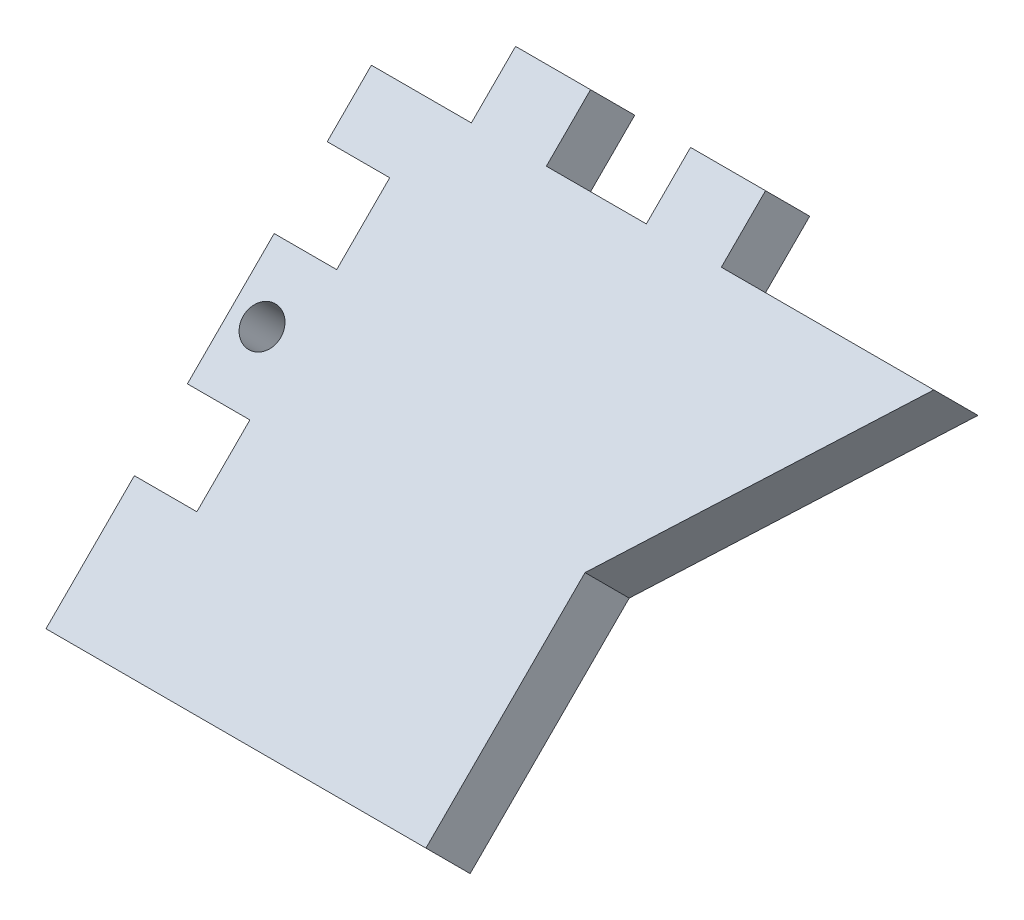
ISO-10303-21;
HEADER;
FILE_DESCRIPTION(('STEP AP214'),'2;1');
FILE_NAME('part.step','',(''),(''),'','','');
FILE_SCHEMA(('AUTOMOTIVE_DESIGN { 1 0 10303 214 1 1 1 1 }'));
ENDSEC;
DATA;
#1=APPLICATION_CONTEXT('core data for automotive mechanical design processes');
#2=APPLICATION_PROTOCOL_DEFINITION('international standard','automotive_design',2000,#1);
#3=PRODUCT_CONTEXT('',#1,'mechanical');
#4=PRODUCT('Part','Part','',(#3));
#5=PRODUCT_RELATED_PRODUCT_CATEGORY('part','',(#4));
#6=PRODUCT_DEFINITION_FORMATION('','',#4);
#7=PRODUCT_DEFINITION_CONTEXT('part definition',#1,'design');
#8=PRODUCT_DEFINITION('design','',#6,#7);
#9=PRODUCT_DEFINITION_SHAPE('','',#8);
#10=(LENGTH_UNIT() NAMED_UNIT(*) SI_UNIT(.MILLI.,.METRE.));
#11=(NAMED_UNIT(*) PLANE_ANGLE_UNIT() SI_UNIT($,.RADIAN.));
#12=(NAMED_UNIT(*) SI_UNIT($,.STERADIAN.) SOLID_ANGLE_UNIT());
#13=UNCERTAINTY_MEASURE_WITH_UNIT(LENGTH_MEASURE(1.E-05),#10,'distance_accuracy_value','');
#14=(GEOMETRIC_REPRESENTATION_CONTEXT(3) GLOBAL_UNCERTAINTY_ASSIGNED_CONTEXT((#13)) GLOBAL_UNIT_ASSIGNED_CONTEXT((#10,
#11,#12)) REPRESENTATION_CONTEXT('',''));
#15=CARTESIAN_POINT('',(0.,0.,0.));
#16=DIRECTION('',(0.,0.,1.));
#17=DIRECTION('',(1.,0.,0.));
#18=AXIS2_PLACEMENT_3D('',#15,#16,#17);
#19=CARTESIAN_POINT('',(0.,18.8585378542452,-9.87828173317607));
#20=DIRECTION('',(0.,0.707106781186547,-0.707106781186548));
#21=DIRECTION('',(0.,0.707106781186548,0.707106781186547));
#22=AXIS2_PLACEMENT_3D('',#19,#20,#21);
#23=PLANE('',#22);
#24=DIRECTION('',(1.,0.,0.));
#25=VECTOR('',#24,1.);
#26=CARTESIAN_POINT('',(0.,14.3684097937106,-14.3684097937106));
#27=LINE('',#26,#25);
#28=CARTESIAN_POINT('',(0.,14.3684097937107,-14.3684097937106));
#29=VERTEX_POINT('',#28);
#30=CARTESIAN_POINT('',(6.35,14.3684097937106,-14.3684097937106));
#31=VERTEX_POINT('',#30);
#32=EDGE_CURVE('E230',#29,#31,#27,.T.);
#33=ORIENTED_EDGE('',*,*,#32,.T.);
#34=DIRECTION('',(0.,-0.707106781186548,-0.707106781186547));
#35=VECTOR('',#34,1.);
#36=CARTESIAN_POINT('',(6.35,18.8585378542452,-9.87828173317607));
#37=LINE('',#36,#35);
#38=CARTESIAN_POINT('',(6.35,18.8585378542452,-9.87828173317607));
#39=VERTEX_POINT('',#38);
#40=EDGE_CURVE('E11',#39,#31,#37,.T.);
#41=ORIENTED_EDGE('',*,*,#40,.F.);
#42=DIRECTION('',(1.,0.,0.));
#43=VECTOR('',#42,1.);
#44=CARTESIAN_POINT('',(0.,18.8585378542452,-9.87828173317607));
#45=LINE('',#44,#43);
#46=CARTESIAN_POINT('',(0.,18.8585378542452,-9.87828173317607));
#47=VERTEX_POINT('',#46);
#48=EDGE_CURVE('E376',#47,#39,#45,.T.);
#49=ORIENTED_EDGE('',*,*,#48,.F.);
#50=DIRECTION('',(0.,-0.707106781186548,-0.707106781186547));
#51=VECTOR('',#50,1.);
#52=CARTESIAN_POINT('',(0.,18.8585378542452,-9.87828173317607));
#53=LINE('',#52,#51);
#54=EDGE_CURVE('E64',#47,#29,#53,.T.);
#55=ORIENTED_EDGE('',*,*,#54,.T.);
#56=EDGE_LOOP('',(#33,#41,#49,#55));
#57=FACE_BOUND('',#56,.T.);
#58=ADVANCED_FACE('F47',(#57),#23,.F.);
#59=CARTESIAN_POINT('',(6.35,4.49012806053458,4.49012806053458));
#60=DIRECTION('',(1.,0.,0.));
#61=DIRECTION('',(0.,0.,-1.));
#62=AXIS2_PLACEMENT_3D('',#59,#60,#61);
#63=PLANE('',#62);
#64=DIRECTION('',(0.,-0.707106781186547,0.707106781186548));
#65=VECTOR('',#64,1.);
#66=CARTESIAN_POINT('',(6.35,0.,0.));
#67=LINE('',#66,#65);
#68=CARTESIAN_POINT('',(6.35,8.98025612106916,-8.98025612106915));
#69=VERTEX_POINT('',#68);
#70=EDGE_CURVE('E233',#31,#69,#67,.T.);
#71=ORIENTED_EDGE('',*,*,#70,.T.);
#72=DIRECTION('',(0.,-0.707106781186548,-0.707106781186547));
#73=VECTOR('',#72,1.);
#74=CARTESIAN_POINT('',(6.35,13.4703841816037,-4.49012806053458));
#75=LINE('',#74,#73);
#76=CARTESIAN_POINT('',(6.35,13.4703841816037,-4.49012806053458));
#77=VERTEX_POINT('',#76);
#78=EDGE_CURVE('E56',#77,#69,#75,.T.);
#79=ORIENTED_EDGE('',*,*,#78,.F.);
#80=DIRECTION('',(0.,-0.707106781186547,0.707106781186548));
#81=VECTOR('',#80,1.);
#82=CARTESIAN_POINT('',(6.35,4.49012806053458,4.49012806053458));
#83=LINE('',#82,#81);
#84=EDGE_CURVE('E141',#39,#77,#83,.T.);
#85=ORIENTED_EDGE('',*,*,#84,.F.);
#86=ORIENTED_EDGE('',*,*,#40,.T.);
#87=EDGE_LOOP('',(#71,#79,#85,#86));
#88=FACE_BOUND('',#87,.T.);
#89=ADVANCED_FACE('F358',(#88),#63,.F.);
#90=CARTESIAN_POINT('',(0.,13.4703841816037,-4.49012806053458));
#91=DIRECTION('',(0.,0.707106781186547,-0.707106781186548));
#92=DIRECTION('',(0.,0.707106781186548,0.707106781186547));
#93=AXIS2_PLACEMENT_3D('',#90,#91,#92);
#94=PLANE('',#93);
#95=DIRECTION('',(1.,0.,0.));
#96=VECTOR('',#95,1.);
#97=CARTESIAN_POINT('',(0.,8.98025612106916,-8.98025612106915));
#98=LINE('',#97,#96);
#99=CARTESIAN_POINT('',(0.,8.98025612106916,-8.98025612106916));
#100=VERTEX_POINT('',#99);
#101=EDGE_CURVE('E238',#100,#69,#98,.T.);
#102=ORIENTED_EDGE('',*,*,#101,.F.);
#103=DIRECTION('',(0.,-0.707106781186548,-0.707106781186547));
#104=VECTOR('',#103,1.);
#105=CARTESIAN_POINT('',(0.,13.4703841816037,-4.49012806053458));
#106=LINE('',#105,#104);
#107=CARTESIAN_POINT('',(0.,13.4703841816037,-4.49012806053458));
#108=VERTEX_POINT('',#107);
#109=EDGE_CURVE('E349',#108,#100,#106,.T.);
#110=ORIENTED_EDGE('',*,*,#109,.F.);
#111=DIRECTION('',(1.,0.,0.));
#112=VECTOR('',#111,1.);
#113=CARTESIAN_POINT('',(0.,13.4703841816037,-4.49012806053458));
#114=LINE('',#113,#112);
#115=EDGE_CURVE('E357',#108,#77,#114,.T.);
#116=ORIENTED_EDGE('',*,*,#115,.T.);
#117=ORIENTED_EDGE('',*,*,#78,.T.);
#118=EDGE_LOOP('',(#102,#110,#116,#117));
#119=FACE_BOUND('',#118,.T.);
#120=ADVANCED_FACE('F355',(#119),#94,.T.);
#121=CARTESIAN_POINT('',(0.,4.49012806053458,4.49012806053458));
#122=DIRECTION('',(-1.,0.,0.));
#123=DIRECTION('',(0.,0.,1.));
#124=AXIS2_PLACEMENT_3D('',#121,#122,#123);
#125=PLANE('',#124);
#126=DIRECTION('',(0.,0.707106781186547,-0.707106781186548));
#127=VECTOR('',#126,1.);
#128=CARTESIAN_POINT('',(0.,0.,0.));
#129=LINE('',#128,#127);
#130=CARTESIAN_POINT('',(0.,0.,0.));
#131=VERTEX_POINT('',#130);
#132=EDGE_CURVE('E242',#131,#100,#129,.T.);
#133=ORIENTED_EDGE('',*,*,#132,.F.);
#134=DIRECTION('',(0.,-0.707106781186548,-0.707106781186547));
#135=VECTOR('',#134,1.);
#136=CARTESIAN_POINT('',(0.,4.49012806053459,4.49012806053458));
#137=LINE('',#136,#135);
#138=CARTESIAN_POINT('',(0.,4.49012806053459,4.49012806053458));
#139=VERTEX_POINT('',#138);
#140=EDGE_CURVE('E346',#139,#131,#137,.T.);
#141=ORIENTED_EDGE('',*,*,#140,.F.);
#142=DIRECTION('',(0.,0.707106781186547,-0.707106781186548));
#143=VECTOR('',#142,1.);
#144=CARTESIAN_POINT('',(0.,4.49012806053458,4.49012806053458));
#145=LINE('',#144,#143);
#146=EDGE_CURVE('E227',#139,#108,#145,.T.);
#147=ORIENTED_EDGE('',*,*,#146,.T.);
#148=ORIENTED_EDGE('',*,*,#109,.T.);
#149=EDGE_LOOP('',(#133,#141,#147,#148));
#150=FACE_BOUND('',#149,.T.);
#151=ADVANCED_FACE('F366',(#150),#125,.T.);
#152=CARTESIAN_POINT('',(0.,4.49012806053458,4.49012806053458));
#153=DIRECTION('',(0.,-0.707106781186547,0.707106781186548));
#154=DIRECTION('',(0.,-0.707106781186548,-0.707106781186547));
#155=AXIS2_PLACEMENT_3D('',#152,#153,#154);
#156=PLANE('',#155);
#157=DIRECTION('',(-1.,0.,0.));
#158=VECTOR('',#157,1.);
#159=CARTESIAN_POINT('',(0.,0.,0.));
#160=LINE('',#159,#158);
#161=CARTESIAN_POINT('',(38.608,0.,0.));
#162=VERTEX_POINT('',#161);
#163=EDGE_CURVE('E246',#162,#131,#160,.T.);
#164=ORIENTED_EDGE('',*,*,#163,.F.);
#165=DIRECTION('',(0.,-0.707106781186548,-0.707106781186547));
#166=VECTOR('',#165,1.);
#167=CARTESIAN_POINT('',(38.608,4.49012806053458,4.49012806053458));
#168=LINE('',#167,#166);
#169=CARTESIAN_POINT('',(38.608,4.49012806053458,4.49012806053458));
#170=VERTEX_POINT('',#169);
#171=EDGE_CURVE('E343',#170,#162,#168,.T.);
#172=ORIENTED_EDGE('',*,*,#171,.F.);
#173=DIRECTION('',(-1.,0.,0.));
#174=VECTOR('',#173,1.);
#175=CARTESIAN_POINT('',(0.,4.49012806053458,4.49012806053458));
#176=LINE('',#175,#174);
#177=EDGE_CURVE('E375',#170,#139,#176,.T.);
#178=ORIENTED_EDGE('',*,*,#177,.T.);
#179=ORIENTED_EDGE('',*,*,#140,.T.);
#180=EDGE_LOOP('',(#164,#172,#178,#179));
#181=FACE_BOUND('',#180,.T.);
#182=ADVANCED_FACE('F473',(#181),#156,.T.);
#183=CARTESIAN_POINT('',(38.608,4.49012806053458,4.49012806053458));
#184=DIRECTION('',(-1.,0.,0.));
#185=DIRECTION('',(0.,0.,1.));
#186=AXIS2_PLACEMENT_3D('',#183,#184,#185);
#187=PLANE('',#186);
#188=DIRECTION('',(0.,0.707106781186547,-0.707106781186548));
#189=VECTOR('',#188,1.);
#190=CARTESIAN_POINT('',(38.608,0.,0.));
#191=LINE('',#190,#189);
#192=CARTESIAN_POINT('',(38.608,16.1644610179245,-16.1644610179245));
#193=VERTEX_POINT('',#192);
#194=EDGE_CURVE('E252',#162,#193,#191,.T.);
#195=ORIENTED_EDGE('',*,*,#194,.T.);
#196=DIRECTION('',(0.,-0.707106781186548,-0.707106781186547));
#197=VECTOR('',#196,1.);
#198=CARTESIAN_POINT('',(38.608,20.6545890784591,-11.6743329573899));
#199=LINE('',#198,#197);
#200=CARTESIAN_POINT('',(38.608,20.6545890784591,-11.6743329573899));
#201=VERTEX_POINT('',#200);
#202=EDGE_CURVE('E340',#201,#193,#199,.T.);
#203=ORIENTED_EDGE('',*,*,#202,.F.);
#204=DIRECTION('',(0.,0.707106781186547,-0.707106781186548));
#205=VECTOR('',#204,1.);
#206=CARTESIAN_POINT('',(38.608,4.49012806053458,4.49012806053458));
#207=LINE('',#206,#205);
#208=EDGE_CURVE('E382',#170,#201,#207,.T.);
#209=ORIENTED_EDGE('',*,*,#208,.F.);
#210=ORIENTED_EDGE('',*,*,#171,.T.);
#211=EDGE_LOOP('',(#195,#203,#209,#210));
#212=FACE_BOUND('',#211,.T.);
#213=ADVANCED_FACE('F476',(#212),#187,.F.);
#214=CARTESIAN_POINT('',(13.0291407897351,-2.65779996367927,11.6380560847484));
#215=DIRECTION('',(0.790088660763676,-0.433451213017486,0.433451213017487));
#216=DIRECTION('',(0.480983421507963,0.,-0.876729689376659));
#217=AXIS2_PLACEMENT_3D('',#214,#215,#216);
#218=PLANE('',#217);
#219=DIRECTION('',(-0.612992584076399,-0.558677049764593,0.558677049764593));
#220=VECTOR('',#219,1.);
#221=CARTESIAN_POINT('',(13.0291407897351,-7.14792802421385,7.14792802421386));
#222=LINE('',#221,#220);
#223=CARTESIAN_POINT('',(57.15,33.0635069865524,-33.0635069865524));
#224=VERTEX_POINT('',#223);
#225=EDGE_CURVE('E256',#224,#193,#222,.T.);
#226=ORIENTED_EDGE('',*,*,#225,.F.);
#227=DIRECTION('',(0.,-0.707106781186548,-0.707106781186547));
#228=VECTOR('',#227,1.);
#229=CARTESIAN_POINT('',(57.15,37.553635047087,-28.5733789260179));
#230=LINE('',#229,#228);
#231=CARTESIAN_POINT('',(57.15,37.553635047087,-28.5733789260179));
#232=VERTEX_POINT('',#231);
#233=EDGE_CURVE('E337',#232,#224,#230,.T.);
#234=ORIENTED_EDGE('',*,*,#233,.F.);
#235=DIRECTION('',(-0.612992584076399,-0.558677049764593,0.558677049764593));
#236=VECTOR('',#235,1.);
#237=CARTESIAN_POINT('',(13.0291407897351,-2.65779996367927,11.6380560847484));
#238=LINE('',#237,#236);
#239=EDGE_CURVE('E385',#232,#201,#238,.T.);
#240=ORIENTED_EDGE('',*,*,#239,.T.);
#241=ORIENTED_EDGE('',*,*,#202,.T.);
#242=EDGE_LOOP('',(#226,#234,#240,#241));
#243=FACE_BOUND('',#242,.T.);
#244=ADVANCED_FACE('F480',(#243),#218,.T.);
#245=CARTESIAN_POINT('',(0.,37.553635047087,-28.5733789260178));
#246=DIRECTION('',(0.,0.707106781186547,-0.707106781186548));
#247=DIRECTION('',(0.,0.707106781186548,0.707106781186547));
#248=AXIS2_PLACEMENT_3D('',#245,#246,#247);
#249=PLANE('',#248);
#250=DIRECTION('',(1.,0.,0.));
#251=VECTOR('',#250,1.);
#252=CARTESIAN_POINT('',(0.,33.0635069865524,-33.0635069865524));
#253=LINE('',#252,#251);
#254=CARTESIAN_POINT('',(35.56,33.0635069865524,-33.0635069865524));
#255=VERTEX_POINT('',#254);
#256=EDGE_CURVE('E260',#255,#224,#253,.T.);
#257=ORIENTED_EDGE('',*,*,#256,.F.);
#258=DIRECTION('',(0.,-0.707106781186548,-0.707106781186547));
#259=VECTOR('',#258,1.);
#260=CARTESIAN_POINT('',(35.56,37.553635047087,-28.5733789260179));
#261=LINE('',#260,#259);
#262=CARTESIAN_POINT('',(35.56,37.553635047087,-28.5733789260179));
#263=VERTEX_POINT('',#262);
#264=EDGE_CURVE('E334',#263,#255,#261,.T.);
#265=ORIENTED_EDGE('',*,*,#264,.F.);
#266=DIRECTION('',(1.,0.,0.));
#267=VECTOR('',#266,1.);
#268=CARTESIAN_POINT('',(0.,37.553635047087,-28.5733789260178));
#269=LINE('',#268,#267);
#270=EDGE_CURVE('E389',#263,#232,#269,.T.);
#271=ORIENTED_EDGE('',*,*,#270,.T.);
#272=ORIENTED_EDGE('',*,*,#233,.T.);
#273=EDGE_LOOP('',(#257,#265,#271,#272));
#274=FACE_BOUND('',#273,.T.);
#275=ADVANCED_FACE('F484',(#274),#249,.T.);
#276=CARTESIAN_POINT('',(35.56,4.49012806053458,4.49012806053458));
#277=DIRECTION('',(1.,0.,0.));
#278=DIRECTION('',(0.,0.,-1.));
#279=AXIS2_PLACEMENT_3D('',#276,#277,#278);
#280=PLANE('',#279);
#281=DIRECTION('',(0.,-0.707106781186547,0.707106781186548));
#282=VECTOR('',#281,1.);
#283=CARTESIAN_POINT('',(35.56,0.,0.));
#284=LINE('',#283,#282);
#285=CARTESIAN_POINT('',(35.56,37.553635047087,-37.553635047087));
#286=VERTEX_POINT('',#285);
#287=EDGE_CURVE('E264',#286,#255,#284,.T.);
#288=ORIENTED_EDGE('',*,*,#287,.F.);
#289=DIRECTION('',(0.,-0.707106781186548,-0.707106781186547));
#290=VECTOR('',#289,1.);
#291=CARTESIAN_POINT('',(35.56,42.0437631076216,-33.0635069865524));
#292=LINE('',#291,#290);
#293=CARTESIAN_POINT('',(35.56,42.0437631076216,-33.0635069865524));
#294=VERTEX_POINT('',#293);
#295=EDGE_CURVE('E331',#294,#286,#292,.T.);
#296=ORIENTED_EDGE('',*,*,#295,.F.);
#297=DIRECTION('',(0.,-0.707106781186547,0.707106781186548));
#298=VECTOR('',#297,1.);
#299=CARTESIAN_POINT('',(35.56,4.49012806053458,4.49012806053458));
#300=LINE('',#299,#298);
#301=EDGE_CURVE('E393',#294,#263,#300,.T.);
#302=ORIENTED_EDGE('',*,*,#301,.T.);
#303=ORIENTED_EDGE('',*,*,#264,.T.);
#304=EDGE_LOOP('',(#288,#296,#302,#303));
#305=FACE_BOUND('',#304,.T.);
#306=ADVANCED_FACE('F488',(#305),#280,.T.);
#307=CARTESIAN_POINT('',(0.,42.0437631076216,-33.0635069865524));
#308=DIRECTION('',(0.,0.707106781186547,-0.707106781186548));
#309=DIRECTION('',(0.,0.707106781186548,0.707106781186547));
#310=AXIS2_PLACEMENT_3D('',#307,#308,#309);
#311=PLANE('',#310);
#312=DIRECTION('',(1.,0.,0.));
#313=VECTOR('',#312,1.);
#314=CARTESIAN_POINT('',(0.,37.553635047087,-37.553635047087));
#315=LINE('',#314,#313);
#316=CARTESIAN_POINT('',(27.94,37.553635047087,-37.553635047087));
#317=VERTEX_POINT('',#316);
#318=EDGE_CURVE('E268',#317,#286,#315,.T.);
#319=ORIENTED_EDGE('',*,*,#318,.F.);
#320=DIRECTION('',(0.,-0.707106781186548,-0.707106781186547));
#321=VECTOR('',#320,1.);
#322=CARTESIAN_POINT('',(27.94,42.0437631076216,-33.0635069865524));
#323=LINE('',#322,#321);
#324=CARTESIAN_POINT('',(27.94,42.0437631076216,-33.0635069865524));
#325=VERTEX_POINT('',#324);
#326=EDGE_CURVE('E328',#325,#317,#323,.T.);
#327=ORIENTED_EDGE('',*,*,#326,.F.);
#328=DIRECTION('',(1.,0.,0.));
#329=VECTOR('',#328,1.);
#330=CARTESIAN_POINT('',(0.,42.0437631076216,-33.0635069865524));
#331=LINE('',#330,#329);
#332=EDGE_CURVE('E397',#325,#294,#331,.T.);
#333=ORIENTED_EDGE('',*,*,#332,.T.);
#334=ORIENTED_EDGE('',*,*,#295,.T.);
#335=EDGE_LOOP('',(#319,#327,#333,#334));
#336=FACE_BOUND('',#335,.T.);
#337=ADVANCED_FACE('F492',(#336),#311,.T.);
#338=CARTESIAN_POINT('',(27.94,4.49012806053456,4.4901280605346));
#339=DIRECTION('',(1.,0.,0.));
#340=DIRECTION('',(0.,0.,-1.));
#341=AXIS2_PLACEMENT_3D('',#338,#339,#340);
#342=PLANE('',#341);
#343=DIRECTION('',(0.,-0.707106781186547,0.707106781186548));
#344=VECTOR('',#343,1.);
#345=CARTESIAN_POINT('',(27.94,0.,0.));
#346=LINE('',#345,#344);
#347=CARTESIAN_POINT('',(27.94,33.0635069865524,-33.0635069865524));
#348=VERTEX_POINT('',#347);
#349=EDGE_CURVE('E272',#317,#348,#346,.T.);
#350=ORIENTED_EDGE('',*,*,#349,.T.);
#351=DIRECTION('',(0.,-0.707106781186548,-0.707106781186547));
#352=VECTOR('',#351,1.);
#353=CARTESIAN_POINT('',(27.94,37.553635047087,-28.5733789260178));
#354=LINE('',#353,#352);
#355=CARTESIAN_POINT('',(27.94,37.553635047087,-28.5733789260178));
#356=VERTEX_POINT('',#355);
#357=EDGE_CURVE('E325',#356,#348,#354,.T.);
#358=ORIENTED_EDGE('',*,*,#357,.F.);
#359=DIRECTION('',(0.,-0.707106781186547,0.707106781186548));
#360=VECTOR('',#359,1.);
#361=CARTESIAN_POINT('',(27.94,4.49012806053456,4.4901280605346));
#362=LINE('',#361,#360);
#363=EDGE_CURVE('E401',#325,#356,#362,.T.);
#364=ORIENTED_EDGE('',*,*,#363,.F.);
#365=ORIENTED_EDGE('',*,*,#326,.T.);
#366=EDGE_LOOP('',(#350,#358,#364,#365));
#367=FACE_BOUND('',#366,.T.);
#368=ADVANCED_FACE('F494',(#367),#342,.F.);
#369=CARTESIAN_POINT('',(0.,37.553635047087,-28.5733789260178));
#370=DIRECTION('',(0.,0.707106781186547,-0.707106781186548));
#371=DIRECTION('',(0.,0.707106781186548,0.707106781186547));
#372=AXIS2_PLACEMENT_3D('',#369,#370,#371);
#373=PLANE('',#372);
#374=DIRECTION('',(1.,0.,0.));
#375=VECTOR('',#374,1.);
#376=CARTESIAN_POINT('',(0.,33.0635069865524,-33.0635069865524));
#377=LINE('',#376,#375);
#378=CARTESIAN_POINT('',(17.78,33.0635069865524,-33.0635069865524));
#379=VERTEX_POINT('',#378);
#380=EDGE_CURVE('E277',#379,#348,#377,.T.);
#381=ORIENTED_EDGE('',*,*,#380,.F.);
#382=DIRECTION('',(0.,-0.707106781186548,-0.707106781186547));
#383=VECTOR('',#382,1.);
#384=CARTESIAN_POINT('',(17.78,37.553635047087,-28.5733789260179));
#385=LINE('',#384,#383);
#386=CARTESIAN_POINT('',(17.78,37.553635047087,-28.5733789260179));
#387=VERTEX_POINT('',#386);
#388=EDGE_CURVE('E322',#387,#379,#385,.T.);
#389=ORIENTED_EDGE('',*,*,#388,.F.);
#390=DIRECTION('',(1.,0.,0.));
#391=VECTOR('',#390,1.);
#392=CARTESIAN_POINT('',(0.,37.553635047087,-28.5733789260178));
#393=LINE('',#392,#391);
#394=EDGE_CURVE('E405',#387,#356,#393,.T.);
#395=ORIENTED_EDGE('',*,*,#394,.T.);
#396=ORIENTED_EDGE('',*,*,#357,.T.);
#397=EDGE_LOOP('',(#381,#389,#395,#396));
#398=FACE_BOUND('',#397,.T.);
#399=ADVANCED_FACE('F497',(#398),#373,.T.);
#400=CARTESIAN_POINT('',(17.78,4.49012806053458,4.49012806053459));
#401=DIRECTION('',(1.,0.,0.));
#402=DIRECTION('',(0.,0.,-1.));
#403=AXIS2_PLACEMENT_3D('',#400,#401,#402);
#404=PLANE('',#403);
#405=DIRECTION('',(0.,-0.707106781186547,0.707106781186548));
#406=VECTOR('',#405,1.);
#407=CARTESIAN_POINT('',(17.78,0.,0.));
#408=LINE('',#407,#406);
#409=CARTESIAN_POINT('',(17.78,37.553635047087,-37.553635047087));
#410=VERTEX_POINT('',#409);
#411=EDGE_CURVE('E281',#410,#379,#408,.T.);
#412=ORIENTED_EDGE('',*,*,#411,.F.);
#413=DIRECTION('',(0.,-0.707106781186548,-0.707106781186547));
#414=VECTOR('',#413,1.);
#415=CARTESIAN_POINT('',(17.78,42.0437631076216,-33.0635069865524));
#416=LINE('',#415,#414);
#417=CARTESIAN_POINT('',(17.78,42.0437631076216,-33.0635069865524));
#418=VERTEX_POINT('',#417);
#419=EDGE_CURVE('E319',#418,#410,#416,.T.);
#420=ORIENTED_EDGE('',*,*,#419,.F.);
#421=DIRECTION('',(0.,-0.707106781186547,0.707106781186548));
#422=VECTOR('',#421,1.);
#423=CARTESIAN_POINT('',(17.78,4.49012806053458,4.49012806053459));
#424=LINE('',#423,#422);
#425=EDGE_CURVE('E409',#418,#387,#424,.T.);
#426=ORIENTED_EDGE('',*,*,#425,.T.);
#427=ORIENTED_EDGE('',*,*,#388,.T.);
#428=EDGE_LOOP('',(#412,#420,#426,#427));
#429=FACE_BOUND('',#428,.T.);
#430=ADVANCED_FACE('F501',(#429),#404,.T.);
#431=CARTESIAN_POINT('',(10.16,37.553635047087,-37.553635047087));
#432=VERTEX_POINT('',#431);
#433=EDGE_CURVE('E273',#432,#410,#315,.T.);
#434=ORIENTED_EDGE('',*,*,#433,.F.);
#435=DIRECTION('',(0.,-0.707106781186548,-0.707106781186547));
#436=VECTOR('',#435,1.);
#437=CARTESIAN_POINT('',(10.16,42.0437631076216,-33.0635069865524));
#438=LINE('',#437,#436);
#439=CARTESIAN_POINT('',(10.16,42.0437631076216,-33.0635069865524));
#440=VERTEX_POINT('',#439);
#441=EDGE_CURVE('E316',#440,#432,#438,.T.);
#442=ORIENTED_EDGE('',*,*,#441,.F.);
#443=EDGE_CURVE('E402',#440,#418,#331,.T.);
#444=ORIENTED_EDGE('',*,*,#443,.T.);
#445=ORIENTED_EDGE('',*,*,#419,.T.);
#446=EDGE_LOOP('',(#434,#442,#444,#445));
#447=FACE_BOUND('',#446,.T.);
#448=ADVANCED_FACE('F505',(#447),#311,.T.);
#449=CARTESIAN_POINT('',(10.16,4.49012806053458,4.49012806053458));
#450=DIRECTION('',(1.,0.,0.));
#451=DIRECTION('',(0.,0.,-1.));
#452=AXIS2_PLACEMENT_3D('',#449,#450,#451);
#453=PLANE('',#452);
#454=DIRECTION('',(0.,-0.707106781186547,0.707106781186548));
#455=VECTOR('',#454,1.);
#456=CARTESIAN_POINT('',(10.16,0.,0.));
#457=LINE('',#456,#455);
#458=CARTESIAN_POINT('',(10.16,33.0635069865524,-33.0635069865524));
#459=VERTEX_POINT('',#458);
#460=EDGE_CURVE('E285',#432,#459,#457,.T.);
#461=ORIENTED_EDGE('',*,*,#460,.T.);
#462=DIRECTION('',(0.,-0.707106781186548,-0.707106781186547));
#463=VECTOR('',#462,1.);
#464=CARTESIAN_POINT('',(10.16,37.553635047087,-28.5733789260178));
#465=LINE('',#464,#463);
#466=CARTESIAN_POINT('',(10.16,37.553635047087,-28.5733789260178));
#467=VERTEX_POINT('',#466);
#468=EDGE_CURVE('E313',#467,#459,#465,.T.);
#469=ORIENTED_EDGE('',*,*,#468,.F.);
#470=DIRECTION('',(0.,-0.707106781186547,0.707106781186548));
#471=VECTOR('',#470,1.);
#472=CARTESIAN_POINT('',(10.16,4.49012806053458,4.49012806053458));
#473=LINE('',#472,#471);
#474=EDGE_CURVE('E413',#440,#467,#473,.T.);
#475=ORIENTED_EDGE('',*,*,#474,.F.);
#476=ORIENTED_EDGE('',*,*,#441,.T.);
#477=EDGE_LOOP('',(#461,#469,#475,#476));
#478=FACE_BOUND('',#477,.T.);
#479=ADVANCED_FACE('F509',(#478),#453,.F.);
#480=CARTESIAN_POINT('',(0.,37.553635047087,-28.5733789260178));
#481=DIRECTION('',(0.,0.707106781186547,-0.707106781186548));
#482=DIRECTION('',(0.,0.707106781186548,0.707106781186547));
#483=AXIS2_PLACEMENT_3D('',#480,#481,#482);
#484=PLANE('',#483);
#485=DIRECTION('',(1.,0.,0.));
#486=VECTOR('',#485,1.);
#487=CARTESIAN_POINT('',(0.,33.0635069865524,-33.0635069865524));
#488=LINE('',#487,#486);
#489=CARTESIAN_POINT('',(0.,33.0635069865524,-33.0635069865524));
#490=VERTEX_POINT('',#489);
#491=EDGE_CURVE('E289',#490,#459,#488,.T.);
#492=ORIENTED_EDGE('',*,*,#491,.F.);
#493=DIRECTION('',(0.,-0.707106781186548,-0.707106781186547));
#494=VECTOR('',#493,1.);
#495=CARTESIAN_POINT('',(0.,37.553635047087,-28.5733789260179));
#496=LINE('',#495,#494);
#497=CARTESIAN_POINT('',(0.,37.553635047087,-28.5733789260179));
#498=VERTEX_POINT('',#497);
#499=EDGE_CURVE('E310',#498,#490,#496,.T.);
#500=ORIENTED_EDGE('',*,*,#499,.F.);
#501=DIRECTION('',(1.,0.,0.));
#502=VECTOR('',#501,1.);
#503=CARTESIAN_POINT('',(0.,37.553635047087,-28.5733789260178));
#504=LINE('',#503,#502);
#505=EDGE_CURVE('E416',#498,#467,#504,.T.);
#506=ORIENTED_EDGE('',*,*,#505,.T.);
#507=ORIENTED_EDGE('',*,*,#468,.T.);
#508=EDGE_LOOP('',(#492,#500,#506,#507));
#509=FACE_BOUND('',#508,.T.);
#510=ADVANCED_FACE('F431',(#509),#484,.T.);
#511=CARTESIAN_POINT('',(0.,28.575174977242,-28.5751749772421));
#512=VERTEX_POINT('',#511);
#513=EDGE_CURVE('E248',#512,#490,#129,.T.);
#514=ORIENTED_EDGE('',*,*,#513,.F.);
#515=DIRECTION('',(0.,-0.707106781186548,-0.707106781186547));
#516=VECTOR('',#515,1.);
#517=CARTESIAN_POINT('',(0.,33.0653030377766,-24.0850469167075));
#518=LINE('',#517,#516);
#519=CARTESIAN_POINT('',(0.,33.0653030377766,-24.0850469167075));
#520=VERTEX_POINT('',#519);
#521=EDGE_CURVE('E307',#520,#512,#518,.T.);
#522=ORIENTED_EDGE('',*,*,#521,.F.);
#523=EDGE_CURVE('E226',#520,#498,#145,.T.);
#524=ORIENTED_EDGE('',*,*,#523,.T.);
#525=ORIENTED_EDGE('',*,*,#499,.T.);
#526=EDGE_LOOP('',(#514,#522,#524,#525));
#527=FACE_BOUND('',#526,.T.);
#528=ADVANCED_FACE('F424',(#527),#125,.T.);
#529=CARTESIAN_POINT('',(0.,33.0653030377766,-24.0850469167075));
#530=DIRECTION('',(0.,0.707106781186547,-0.707106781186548));
#531=DIRECTION('',(0.,0.707106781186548,0.707106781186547));
#532=AXIS2_PLACEMENT_3D('',#529,#530,#531);
#533=PLANE('',#532);
#534=DIRECTION('',(1.,0.,0.));
#535=VECTOR('',#534,1.);
#536=CARTESIAN_POINT('',(0.,28.575174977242,-28.5751749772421));
#537=LINE('',#536,#535);
#538=CARTESIAN_POINT('',(6.35,28.575174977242,-28.5751749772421));
#539=VERTEX_POINT('',#538);
#540=EDGE_CURVE('E293',#512,#539,#537,.T.);
#541=ORIENTED_EDGE('',*,*,#540,.T.);
#542=DIRECTION('',(0.,-0.707106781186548,-0.707106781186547));
#543=VECTOR('',#542,1.);
#544=CARTESIAN_POINT('',(6.35,33.0653030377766,-24.0850469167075));
#545=LINE('',#544,#543);
#546=CARTESIAN_POINT('',(6.35,33.0653030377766,-24.0850469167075));
#547=VERTEX_POINT('',#546);
#548=EDGE_CURVE('E218',#547,#539,#545,.T.);
#549=ORIENTED_EDGE('',*,*,#548,.F.);
#550=DIRECTION('',(1.,0.,0.));
#551=VECTOR('',#550,1.);
#552=CARTESIAN_POINT('',(0.,33.0653030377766,-24.0850469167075));
#553=LINE('',#552,#551);
#554=EDGE_CURVE('E204',#520,#547,#553,.T.);
#555=ORIENTED_EDGE('',*,*,#554,.F.);
#556=ORIENTED_EDGE('',*,*,#521,.T.);
#557=EDGE_LOOP('',(#541,#549,#555,#556));
#558=FACE_BOUND('',#557,.T.);
#559=ADVANCED_FACE('F516',(#558),#533,.F.);
#560=CARTESIAN_POINT('',(6.35,4.49012806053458,4.49012806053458));
#561=DIRECTION('',(1.,0.,0.));
#562=DIRECTION('',(0.,0.,-1.));
#563=AXIS2_PLACEMENT_3D('',#560,#561,#562);
#564=PLANE('',#563);
#565=DIRECTION('',(0.,-0.707106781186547,0.707106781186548));
#566=VECTOR('',#565,1.);
#567=CARTESIAN_POINT('',(6.35,0.,0.));
#568=LINE('',#567,#566);
#569=CARTESIAN_POINT('',(6.35,23.1870213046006,-23.1870213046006));
#570=VERTEX_POINT('',#569);
#571=EDGE_CURVE('E214',#539,#570,#568,.T.);
#572=ORIENTED_EDGE('',*,*,#571,.T.);
#573=DIRECTION('',(0.,-0.707106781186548,-0.707106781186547));
#574=VECTOR('',#573,1.);
#575=CARTESIAN_POINT('',(6.35,27.6771493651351,-18.696893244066));
#576=LINE('',#575,#574);
#577=CARTESIAN_POINT('',(6.35,27.6771493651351,-18.696893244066));
#578=VERTEX_POINT('',#577);
#579=EDGE_CURVE('E211',#578,#570,#576,.T.);
#580=ORIENTED_EDGE('',*,*,#579,.F.);
#581=DIRECTION('',(0.,-0.707106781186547,0.707106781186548));
#582=VECTOR('',#581,1.);
#583=CARTESIAN_POINT('',(6.35,4.49012806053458,4.49012806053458));
#584=LINE('',#583,#582);
#585=EDGE_CURVE('E196',#547,#578,#584,.T.);
#586=ORIENTED_EDGE('',*,*,#585,.F.);
#587=ORIENTED_EDGE('',*,*,#548,.T.);
#588=EDGE_LOOP('',(#572,#580,#586,#587));
#589=FACE_BOUND('',#588,.T.);
#590=ADVANCED_FACE('F212',(#589),#564,.F.);
#591=CARTESIAN_POINT('',(0.,27.6771493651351,-18.696893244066));
#592=DIRECTION('',(0.,0.707106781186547,-0.707106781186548));
#593=DIRECTION('',(0.,0.707106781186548,0.707106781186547));
#594=AXIS2_PLACEMENT_3D('',#591,#592,#593);
#595=PLANE('',#594);
#596=DIRECTION('',(1.,0.,0.));
#597=VECTOR('',#596,1.);
#598=CARTESIAN_POINT('',(0.,23.1870213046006,-23.1870213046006));
#599=LINE('',#598,#597);
#600=CARTESIAN_POINT('',(0.,23.1870213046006,-23.1870213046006));
#601=VERTEX_POINT('',#600);
#602=EDGE_CURVE('E298',#601,#570,#599,.T.);
#603=ORIENTED_EDGE('',*,*,#602,.F.);
#604=DIRECTION('',(0.,-0.707106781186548,-0.707106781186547));
#605=VECTOR('',#604,1.);
#606=CARTESIAN_POINT('',(0.,27.6771493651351,-18.696893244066));
#607=LINE('',#606,#605);
#608=CARTESIAN_POINT('',(0.,27.6771493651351,-18.696893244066));
#609=VERTEX_POINT('',#608);
#610=EDGE_CURVE('E129',#609,#601,#607,.T.);
#611=ORIENTED_EDGE('',*,*,#610,.F.);
#612=DIRECTION('',(1.,0.,0.));
#613=VECTOR('',#612,1.);
#614=CARTESIAN_POINT('',(0.,27.6771493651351,-18.696893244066));
#615=LINE('',#614,#613);
#616=EDGE_CURVE('E201',#609,#578,#615,.T.);
#617=ORIENTED_EDGE('',*,*,#616,.T.);
#618=ORIENTED_EDGE('',*,*,#579,.T.);
#619=EDGE_LOOP('',(#603,#611,#617,#618));
#620=FACE_BOUND('',#619,.T.);
#621=ADVANCED_FACE('F220',(#620),#595,.T.);
#622=EDGE_CURVE('E247',#29,#601,#129,.T.);
#623=ORIENTED_EDGE('',*,*,#622,.F.);
#624=ORIENTED_EDGE('',*,*,#54,.F.);
#625=EDGE_CURVE('E222',#47,#609,#145,.T.);
#626=ORIENTED_EDGE('',*,*,#625,.T.);
#627=ORIENTED_EDGE('',*,*,#610,.T.);
#628=EDGE_LOOP('',(#623,#624,#626,#627));
#629=FACE_BOUND('',#628,.T.);
#630=ADVANCED_FACE('F456',(#629),#125,.T.);
#631=CARTESIAN_POINT('',(0.,4.49012806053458,4.49012806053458));
#632=DIRECTION('',(0.,0.707106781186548,0.707106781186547));
#633=DIRECTION('',(0.,-0.707106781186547,0.707106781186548));
#634=AXIS2_PLACEMENT_3D('',#631,#632,#633);
#635=PLANE('',#634);
#636=CARTESIAN_POINT('',(3.175,23.2678436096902,-14.287587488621));
#637=DIRECTION('',(0.,0.707106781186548,0.707106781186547));
#638=DIRECTION('',(0.,-0.707106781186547,0.707106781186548));
#639=AXIS2_PLACEMENT_3D('',#636,#637,#638);
#640=CIRCLE('',#639,1.905);
#641=CARTESIAN_POINT('',(3.175,21.9208051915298,-12.9405490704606));
#642=VERTEX_POINT('',#641);
#643=EDGE_CURVE('E440',#642,#642,#640,.T.);
#644=ORIENTED_EDGE('',*,*,#643,.F.);
#645=EDGE_LOOP('',(#644));
#646=FACE_BOUND('',#645,.T.);
#647=ORIENTED_EDGE('',*,*,#48,.T.);
#648=ORIENTED_EDGE('',*,*,#84,.T.);
#649=ORIENTED_EDGE('',*,*,#115,.F.);
#650=ORIENTED_EDGE('',*,*,#146,.F.);
#651=ORIENTED_EDGE('',*,*,#177,.F.);
#652=ORIENTED_EDGE('',*,*,#208,.T.);
#653=ORIENTED_EDGE('',*,*,#239,.F.);
#654=ORIENTED_EDGE('',*,*,#270,.F.);
#655=ORIENTED_EDGE('',*,*,#301,.F.);
#656=ORIENTED_EDGE('',*,*,#332,.F.);
#657=ORIENTED_EDGE('',*,*,#363,.T.);
#658=ORIENTED_EDGE('',*,*,#394,.F.);
#659=ORIENTED_EDGE('',*,*,#425,.F.);
#660=ORIENTED_EDGE('',*,*,#443,.F.);
#661=ORIENTED_EDGE('',*,*,#474,.T.);
#662=ORIENTED_EDGE('',*,*,#505,.F.);
#663=ORIENTED_EDGE('',*,*,#523,.F.);
#664=ORIENTED_EDGE('',*,*,#554,.T.);
#665=ORIENTED_EDGE('',*,*,#585,.T.);
#666=ORIENTED_EDGE('',*,*,#616,.F.);
#667=ORIENTED_EDGE('',*,*,#625,.F.);
#668=EDGE_LOOP('',(#647,#648,#649,#650,#651,#652,#653,#654,#655,#656,#657,#658,#659,#660,#661,
#662,#663,#664,#665,#666,#667));
#669=FACE_BOUND('',#668,.T.);
#670=ADVANCED_FACE('F198',(#646,#669),#635,.T.);
#671=CARTESIAN_POINT('',(0.,0.,0.));
#672=DIRECTION('',(0.,0.707106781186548,0.707106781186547));
#673=DIRECTION('',(0.,-0.707106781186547,0.707106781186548));
#674=AXIS2_PLACEMENT_3D('',#671,#672,#673);
#675=PLANE('',#674);
#676=CARTESIAN_POINT('',(3.175,18.7777155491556,-18.7777155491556));
#677=DIRECTION('',(0.,0.707106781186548,0.707106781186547));
#678=DIRECTION('',(0.,-0.707106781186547,0.707106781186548));
#679=AXIS2_PLACEMENT_3D('',#676,#677,#678);
#680=CIRCLE('',#679,1.905);
#681=CARTESIAN_POINT('',(3.175,17.4306771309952,-17.4306771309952));
#682=VERTEX_POINT('',#681);
#683=EDGE_CURVE('E234',#682,#682,#680,.T.);
#684=ORIENTED_EDGE('',*,*,#683,.T.);
#685=EDGE_LOOP('',(#684));
#686=FACE_BOUND('',#685,.T.);
#687=ORIENTED_EDGE('',*,*,#32,.F.);
#688=ORIENTED_EDGE('',*,*,#622,.T.);
#689=ORIENTED_EDGE('',*,*,#602,.T.);
#690=ORIENTED_EDGE('',*,*,#571,.F.);
#691=ORIENTED_EDGE('',*,*,#540,.F.);
#692=ORIENTED_EDGE('',*,*,#513,.T.);
#693=ORIENTED_EDGE('',*,*,#491,.T.);
#694=ORIENTED_EDGE('',*,*,#460,.F.);
#695=ORIENTED_EDGE('',*,*,#433,.T.);
#696=ORIENTED_EDGE('',*,*,#411,.T.);
#697=ORIENTED_EDGE('',*,*,#380,.T.);
#698=ORIENTED_EDGE('',*,*,#349,.F.);
#699=ORIENTED_EDGE('',*,*,#318,.T.);
#700=ORIENTED_EDGE('',*,*,#287,.T.);
#701=ORIENTED_EDGE('',*,*,#256,.T.);
#702=ORIENTED_EDGE('',*,*,#225,.T.);
#703=ORIENTED_EDGE('',*,*,#194,.F.);
#704=ORIENTED_EDGE('',*,*,#163,.T.);
#705=ORIENTED_EDGE('',*,*,#132,.T.);
#706=ORIENTED_EDGE('',*,*,#101,.T.);
#707=ORIENTED_EDGE('',*,*,#70,.F.);
#708=EDGE_LOOP('',(#687,#688,#689,#690,#691,#692,#693,#694,#695,#696,#697,#698,#699,#700,#701,
#702,#703,#704,#705,#706,#707));
#709=FACE_BOUND('',#708,.T.);
#710=ADVANCED_FACE('F361',(#686,#709),#675,.F.);
#711=CARTESIAN_POINT('',(3.175,18.7777155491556,-18.7777155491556));
#712=DIRECTION('',(0.,0.707106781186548,0.707106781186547));
#713=DIRECTION('',(0.,-0.707106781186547,0.707106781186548));
#714=AXIS2_PLACEMENT_3D('',#711,#712,#713);
#715=CYLINDRICAL_SURFACE('',#714,1.905);
#716=CARTESIAN_POINT('',(3.175,17.4306771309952,-17.4306771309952));
#717=CARTESIAN_POINT('',(3.175,17.4774492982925,-17.383904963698));
#718=CARTESIAN_POINT('',(3.175,17.5242214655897,-17.3371327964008));
#719=CARTESIAN_POINT('',(3.175,17.6177658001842,-17.2435884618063));
#720=CARTESIAN_POINT('',(3.175,17.6645379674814,-17.196816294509));
#721=CARTESIAN_POINT('',(3.175,17.7580823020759,-17.1032719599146));
#722=CARTESIAN_POINT('',(3.175,17.8048544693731,-17.0564997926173));
#723=CARTESIAN_POINT('',(3.175,17.8983988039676,-16.9629554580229));
#724=CARTESIAN_POINT('',(3.175,17.9451709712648,-16.9161832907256));
#725=CARTESIAN_POINT('',(3.175,18.0387153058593,-16.8226389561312));
#726=CARTESIAN_POINT('',(3.175,18.0854874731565,-16.7758667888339));
#727=CARTESIAN_POINT('',(3.175,18.179031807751,-16.6823224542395));
#728=CARTESIAN_POINT('',(3.175,18.2258039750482,-16.6355502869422));
#729=CARTESIAN_POINT('',(3.175,18.3193483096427,-16.5420059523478));
#730=CARTESIAN_POINT('',(3.175,18.3661204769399,-16.4952337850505));
#731=CARTESIAN_POINT('',(3.175,18.4596648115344,-16.4016894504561));
#732=CARTESIAN_POINT('',(3.175,18.5064369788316,-16.3549172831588));
#733=CARTESIAN_POINT('',(3.175,18.5999813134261,-16.2613729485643));
#734=CARTESIAN_POINT('',(3.175,18.6467534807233,-16.2146007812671));
#735=CARTESIAN_POINT('',(3.175,18.7402978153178,-16.1210564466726));
#736=CARTESIAN_POINT('',(3.175,18.7870699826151,-16.0742842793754));
#737=CARTESIAN_POINT('',(3.175,18.8806143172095,-15.9807399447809));
#738=CARTESIAN_POINT('',(3.175,18.9273864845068,-15.9339677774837));
#739=CARTESIAN_POINT('',(3.175,19.0209308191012,-15.8404234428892));
#740=CARTESIAN_POINT('',(3.175,19.0677029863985,-15.793651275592));
#741=CARTESIAN_POINT('',(3.175,19.1612473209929,-15.7001069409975));
#742=CARTESIAN_POINT('',(3.175,19.2080194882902,-15.6533347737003));
#743=CARTESIAN_POINT('',(3.175,19.3015638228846,-15.5597904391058));
#744=CARTESIAN_POINT('',(3.175,19.3483359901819,-15.5130182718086));
#745=CARTESIAN_POINT('',(3.175,19.4418803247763,-15.4194739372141));
#746=CARTESIAN_POINT('',(3.175,19.4886524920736,-15.3727017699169));
#747=CARTESIAN_POINT('',(3.175,19.5821968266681,-15.2791574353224));
#748=CARTESIAN_POINT('',(3.175,19.6289689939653,-15.2323852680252));
#749=CARTESIAN_POINT('',(3.175,19.7225133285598,-15.1388409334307));
#750=CARTESIAN_POINT('',(3.175,19.769285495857,-15.0920687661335));
#751=CARTESIAN_POINT('',(3.175,19.8628298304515,-14.998524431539));
#752=CARTESIAN_POINT('',(3.175,19.9096019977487,-14.9517522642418));
#753=CARTESIAN_POINT('',(3.175,20.0031463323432,-14.8582079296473));
#754=CARTESIAN_POINT('',(3.175,20.0499184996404,-14.8114357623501));
#755=CARTESIAN_POINT('',(3.175,20.1434628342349,-14.7178914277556));
#756=CARTESIAN_POINT('',(3.175,20.1902350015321,-14.6711192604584));
#757=CARTESIAN_POINT('',(3.175,20.2837793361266,-14.5775749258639));
#758=CARTESIAN_POINT('',(3.175,20.3305515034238,-14.5308027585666));
#759=CARTESIAN_POINT('',(3.175,20.4240958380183,-14.4372584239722));
#760=CARTESIAN_POINT('',(3.175,20.4708680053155,-14.3904862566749));
#761=CARTESIAN_POINT('',(3.175,20.56441233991,-14.2969419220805));
#762=CARTESIAN_POINT('',(3.175,20.6111845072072,-14.2501697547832));
#763=CARTESIAN_POINT('',(3.175,20.7047288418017,-14.1566254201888));
#764=CARTESIAN_POINT('',(3.175,20.7515010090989,-14.1098532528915));
#765=CARTESIAN_POINT('',(3.175,20.8450453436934,-14.0163089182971));
#766=CARTESIAN_POINT('',(3.175,20.8918175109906,-13.9695367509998));
#767=CARTESIAN_POINT('',(3.175,20.9853618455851,-13.8759924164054));
#768=CARTESIAN_POINT('',(3.175,21.0321340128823,-13.8292202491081));
#769=CARTESIAN_POINT('',(3.175,21.1256783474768,-13.7356759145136));
#770=CARTESIAN_POINT('',(3.175,21.172450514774,-13.6889037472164));
#771=CARTESIAN_POINT('',(3.175,21.2659948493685,-13.5953594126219));
#772=CARTESIAN_POINT('',(3.175,21.3127670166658,-13.5485872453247));
#773=CARTESIAN_POINT('',(3.175,21.4063113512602,-13.4550429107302));
#774=CARTESIAN_POINT('',(3.175,21.4530835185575,-13.408270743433));
#775=CARTESIAN_POINT('',(3.175,21.5466278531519,-13.3147264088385));
#776=CARTESIAN_POINT('',(3.175,21.5934000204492,-13.2679542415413));
#777=CARTESIAN_POINT('',(3.175,21.6869443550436,-13.1744099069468));
#778=CARTESIAN_POINT('',(3.175,21.7337165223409,-13.1276377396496));
#779=CARTESIAN_POINT('',(3.175,21.8272608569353,-13.0340934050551));
#780=CARTESIAN_POINT('',(3.175,21.8740330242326,-12.9873212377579));
#781=CARTESIAN_POINT('',(3.175,21.9208051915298,-12.9405490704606));
#782=B_SPLINE_CURVE_WITH_KNOTS('',3,(#716,#717,#718,#719,#720,#721,#722,#723,#724,#725,#726,
#727,#728,#729,#730,#731,#732,#733,#734,#735,#736,#737,#738,#739,#740,#741,#742,#743,#744,#745,
#746,#747,#748,#749,#750,#751,#752,#753,#754,#755,#756,#757,#758,#759,#760,#761,#762,#763,#764,
#765,#766,#767,#768,#769,#770,#771,#772,#773,#774,#775,#776,#777,#778,#779,#780,#781),
.UNSPECIFIED.,.F.,.F.,(4,2,2,2,2,2,2,2,2,2,2,2,2,2,2,2,2,2,2,2,2,2,2,2,2,2,2,2,2,2,2,2,4),(0.,
0.198437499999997,0.396874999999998,0.595312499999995,0.793749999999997,0.992187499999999,
1.190625,1.3890625,1.5875,1.7859375,1.984375,2.1828125,2.38125,2.5796875,2.778125,2.9765625,
3.175,3.3734375,3.571875,3.7703125,3.96875,4.1671875,4.365625,4.5640625,4.7625,4.9609375,
5.159375,5.3578125,5.55625,5.7546875,5.953125,6.1515625,6.35),.UNSPECIFIED.);
#783=EDGE_CURVE('BSEAM449',#682,#642,#782,.T.);
#784=ORIENTED_EDGE('',*,*,#683,.F.);
#785=ORIENTED_EDGE('',*,*,#643,.T.);
#786=ORIENTED_EDGE('',*,*,#783,.T.);
#787=ORIENTED_EDGE('',*,*,#783,.F.);
#788=EDGE_LOOP('',(#784,#786,#785,#787));
#789=FACE_BOUND('',#788,.T.);
#790=ADVANCED_FACE('F449',(#789),#715,.F.);
#791=CLOSED_SHELL('',(#58,#89,#120,#151,#182,#213,#244,#275,#306,#337,#368,#399,#430,#448,#479,
#510,#528,#559,#590,#621,#630,#670,#710,#790));
#792=MANIFOLD_SOLID_BREP('B2',#791);
#793=ADVANCED_BREP_SHAPE_REPRESENTATION('',(#18,#792),#14);
#794=SHAPE_DEFINITION_REPRESENTATION(#9,#793);
ENDSEC;
END-ISO-10303-21;
